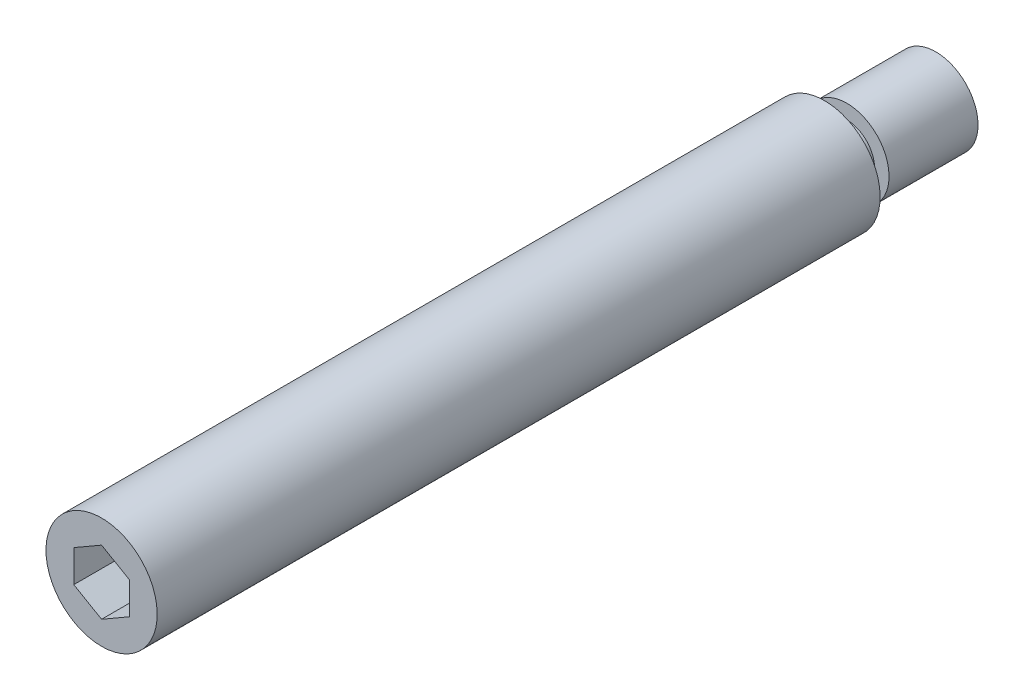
ISO-10303-21;
HEADER;
FILE_DESCRIPTION(('STEP AP214'),'2;1');
FILE_NAME('part.step','',(''),(''),'','','');
FILE_SCHEMA(('AUTOMOTIVE_DESIGN { 1 0 10303 214 1 1 1 1 }'));
ENDSEC;
DATA;
#1=APPLICATION_CONTEXT('core data for automotive mechanical design processes');
#2=APPLICATION_PROTOCOL_DEFINITION('international standard','automotive_design',2000,#1);
#3=PRODUCT_CONTEXT('',#1,'mechanical');
#4=PRODUCT('Part','Part','',(#3));
#5=PRODUCT_RELATED_PRODUCT_CATEGORY('part','',(#4));
#6=PRODUCT_DEFINITION_FORMATION('','',#4);
#7=PRODUCT_DEFINITION_CONTEXT('part definition',#1,'design');
#8=PRODUCT_DEFINITION('design','',#6,#7);
#9=PRODUCT_DEFINITION_SHAPE('','',#8);
#10=(LENGTH_UNIT() NAMED_UNIT(*) SI_UNIT(.MILLI.,.METRE.));
#11=(NAMED_UNIT(*) PLANE_ANGLE_UNIT() SI_UNIT($,.RADIAN.));
#12=(NAMED_UNIT(*) SI_UNIT($,.STERADIAN.) SOLID_ANGLE_UNIT());
#13=UNCERTAINTY_MEASURE_WITH_UNIT(LENGTH_MEASURE(1.E-05),#10,'distance_accuracy_value','');
#14=(GEOMETRIC_REPRESENTATION_CONTEXT(3) GLOBAL_UNCERTAINTY_ASSIGNED_CONTEXT((#13)) GLOBAL_UNIT_ASSIGNED_CONTEXT((#10,
#11,#12)) REPRESENTATION_CONTEXT('',''));
#15=CARTESIAN_POINT('',(0.,0.,0.));
#16=DIRECTION('',(0.,0.,1.));
#17=DIRECTION('',(1.,0.,0.));
#18=AXIS2_PLACEMENT_3D('',#15,#16,#17);
#19=CARTESIAN_POINT('',(0.,5.,10.));
#20=DIRECTION('',(0.,0.,-1.));
#21=DIRECTION('',(0.,1.,0.));
#22=AXIS2_PLACEMENT_3D('',#19,#20,#21);
#23=PLANE('',#22);
#24=CARTESIAN_POINT('',(0.,0.,10.));
#25=DIRECTION('',(0.,0.,1.));
#26=DIRECTION('',(0.,-1.,0.));
#27=AXIS2_PLACEMENT_3D('',#24,#25,#26);
#28=CIRCLE('',#27,2.5);
#29=CARTESIAN_POINT('',(0.,-2.5,10.));
#30=VERTEX_POINT('',#29);
#31=EDGE_CURVE('E115',#30,#30,#28,.T.);
#32=ORIENTED_EDGE('',*,*,#31,.T.);
#33=EDGE_LOOP('',(#32));
#34=FACE_BOUND('',#33,.T.);
#35=CARTESIAN_POINT('',(0.,0.,10.));
#36=DIRECTION('',(0.,0.,1.));
#37=DIRECTION('',(0.,-1.,0.));
#38=AXIS2_PLACEMENT_3D('',#35,#36,#37);
#39=CIRCLE('',#38,5.);
#40=CARTESIAN_POINT('',(0.,-5.,10.));
#41=VERTEX_POINT('',#40);
#42=EDGE_CURVE('E9',#41,#41,#39,.T.);
#43=ORIENTED_EDGE('',*,*,#42,.F.);
#44=EDGE_LOOP('',(#43));
#45=FACE_BOUND('',#44,.T.);
#46=ADVANCED_FACE('F14',(#34,#45),#23,.T.);
#47=CARTESIAN_POINT('',(0.,0.,20.));
#48=DIRECTION('',(0.,0.,1.));
#49=DIRECTION('',(0.,-1.,0.));
#50=AXIS2_PLACEMENT_3D('',#47,#48,#49);
#51=CYLINDRICAL_SURFACE('',#50,5.);
#52=CARTESIAN_POINT('',(0.,0.,75.));
#53=DIRECTION('',(0.,0.,1.));
#54=DIRECTION('',(0.,-1.,0.));
#55=AXIS2_PLACEMENT_3D('',#52,#53,#54);
#56=CIRCLE('',#55,5.);
#57=CARTESIAN_POINT('',(0.,-5.,75.));
#58=VERTEX_POINT('',#57);
#59=EDGE_CURVE('E21',#58,#58,#56,.T.);
#60=ORIENTED_EDGE('',*,*,#59,.F.);
#61=EDGE_LOOP('',(#60));
#62=FACE_BOUND('',#61,.T.);
#63=ORIENTED_EDGE('',*,*,#42,.T.);
#64=EDGE_LOOP('',(#63));
#65=FACE_BOUND('',#64,.T.);
#66=ADVANCED_FACE('F136',(#62,#65),#51,.T.);
#67=CARTESIAN_POINT('',(0.,5.,75.));
#68=DIRECTION('',(0.,0.,-1.));
#69=DIRECTION('',(0.,1.,0.));
#70=AXIS2_PLACEMENT_3D('',#67,#68,#69);
#71=PLANE('',#70);
#72=DIRECTION('',(-0.866025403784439,-0.5,0.));
#73=VECTOR('',#72,1.);
#74=CARTESIAN_POINT('',(0.,2.88675134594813,75.));
#75=LINE('',#74,#73);
#76=CARTESIAN_POINT('',(0.,2.88675134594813,75.));
#77=VERTEX_POINT('',#76);
#78=CARTESIAN_POINT('',(-2.5,1.44337567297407,75.));
#79=VERTEX_POINT('',#78);
#80=EDGE_CURVE('E102',#77,#79,#75,.T.);
#81=ORIENTED_EDGE('',*,*,#80,.F.);
#82=DIRECTION('',(-0.866025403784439,0.5,0.));
#83=VECTOR('',#82,1.);
#84=CARTESIAN_POINT('',(2.5,1.44337567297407,75.));
#85=LINE('',#84,#83);
#86=CARTESIAN_POINT('',(2.5,1.44337567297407,75.));
#87=VERTEX_POINT('',#86);
#88=EDGE_CURVE('E28',#87,#77,#85,.T.);
#89=ORIENTED_EDGE('',*,*,#88,.F.);
#90=DIRECTION('',(0.,1.,0.));
#91=VECTOR('',#90,1.);
#92=CARTESIAN_POINT('',(2.5,-1.44337567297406,75.));
#93=LINE('',#92,#91);
#94=CARTESIAN_POINT('',(2.5,-1.44337567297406,75.));
#95=VERTEX_POINT('',#94);
#96=EDGE_CURVE('E111',#95,#87,#93,.T.);
#97=ORIENTED_EDGE('',*,*,#96,.F.);
#98=DIRECTION('',(0.866025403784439,0.5,0.));
#99=VECTOR('',#98,1.);
#100=CARTESIAN_POINT('',(0.,-2.88675134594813,75.));
#101=LINE('',#100,#99);
#102=CARTESIAN_POINT('',(0.,-2.88675134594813,75.));
#103=VERTEX_POINT('',#102);
#104=EDGE_CURVE('E109',#103,#95,#101,.T.);
#105=ORIENTED_EDGE('',*,*,#104,.F.);
#106=DIRECTION('',(0.866025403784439,-0.5,0.));
#107=VECTOR('',#106,1.);
#108=CARTESIAN_POINT('',(-2.5,-1.44337567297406,75.));
#109=LINE('',#108,#107);
#110=CARTESIAN_POINT('',(-2.5,-1.44337567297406,75.));
#111=VERTEX_POINT('',#110);
#112=EDGE_CURVE('E76',#111,#103,#109,.T.);
#113=ORIENTED_EDGE('',*,*,#112,.F.);
#114=DIRECTION('',(0.,-1.,0.));
#115=VECTOR('',#114,1.);
#116=CARTESIAN_POINT('',(-2.5,1.44337567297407,75.));
#117=LINE('',#116,#115);
#118=EDGE_CURVE('E105',#79,#111,#117,.T.);
#119=ORIENTED_EDGE('',*,*,#118,.F.);
#120=EDGE_LOOP('',(#81,#89,#97,#105,#113,#119));
#121=FACE_BOUND('',#120,.T.);
#122=ORIENTED_EDGE('',*,*,#59,.T.);
#123=EDGE_LOOP('',(#122));
#124=FACE_BOUND('',#123,.T.);
#125=ADVANCED_FACE('F134',(#121,#124),#71,.F.);
#126=CARTESIAN_POINT('',(0.,3.8,0.));
#127=DIRECTION('',(0.,0.,-1.));
#128=DIRECTION('',(0.,1.,0.));
#129=AXIS2_PLACEMENT_3D('',#126,#127,#128);
#130=PLANE('',#129);
#131=CARTESIAN_POINT('',(0.,0.,0.));
#132=DIRECTION('',(0.,0.,1.));
#133=DIRECTION('',(0.,-1.,0.));
#134=AXIS2_PLACEMENT_3D('',#131,#132,#133);
#135=CIRCLE('',#134,3.8);
#136=CARTESIAN_POINT('',(0.,-3.8,0.));
#137=VERTEX_POINT('',#136);
#138=EDGE_CURVE('E129',#137,#137,#135,.T.);
#139=ORIENTED_EDGE('',*,*,#138,.F.);
#140=EDGE_LOOP('',(#139));
#141=FACE_BOUND('',#140,.T.);
#142=ADVANCED_FACE('F167',(#141),#130,.T.);
#143=CARTESIAN_POINT('',(0.,0.,20.));
#144=DIRECTION('',(0.,0.,1.));
#145=DIRECTION('',(0.,-1.,0.));
#146=AXIS2_PLACEMENT_3D('',#143,#144,#145);
#147=CYLINDRICAL_SURFACE('',#146,3.8);
#148=ORIENTED_EDGE('',*,*,#138,.T.);
#149=EDGE_LOOP('',(#148));
#150=FACE_BOUND('',#149,.T.);
#151=CARTESIAN_POINT('',(0.,0.,8.));
#152=DIRECTION('',(0.,0.,1.));
#153=DIRECTION('',(0.,-1.,0.));
#154=AXIS2_PLACEMENT_3D('',#151,#152,#153);
#155=CIRCLE('',#154,3.8);
#156=CARTESIAN_POINT('',(0.,-3.8,8.));
#157=VERTEX_POINT('',#156);
#158=EDGE_CURVE('E126',#157,#157,#155,.T.);
#159=ORIENTED_EDGE('',*,*,#158,.F.);
#160=EDGE_LOOP('',(#159));
#161=FACE_BOUND('',#160,.T.);
#162=ADVANCED_FACE('F160',(#150,#161),#147,.T.);
#163=CARTESIAN_POINT('',(0.,2.5,8.));
#164=DIRECTION('',(0.,0.,1.));
#165=DIRECTION('',(0.,-1.,0.));
#166=AXIS2_PLACEMENT_3D('',#163,#164,#165);
#167=PLANE('',#166);
#168=ORIENTED_EDGE('',*,*,#158,.T.);
#169=EDGE_LOOP('',(#168));
#170=FACE_BOUND('',#169,.T.);
#171=CARTESIAN_POINT('',(0.,0.,8.));
#172=DIRECTION('',(0.,0.,1.));
#173=DIRECTION('',(0.,-1.,0.));
#174=AXIS2_PLACEMENT_3D('',#171,#172,#173);
#175=CIRCLE('',#174,2.5);
#176=CARTESIAN_POINT('',(0.,-2.5,8.));
#177=VERTEX_POINT('',#176);
#178=EDGE_CURVE('E123',#177,#177,#175,.T.);
#179=ORIENTED_EDGE('',*,*,#178,.F.);
#180=EDGE_LOOP('',(#179));
#181=FACE_BOUND('',#180,.T.);
#182=ADVANCED_FACE('F151',(#170,#181),#167,.T.);
#183=CARTESIAN_POINT('',(0.,0.,20.));
#184=DIRECTION('',(0.,0.,1.));
#185=DIRECTION('',(0.,-1.,0.));
#186=AXIS2_PLACEMENT_3D('',#183,#184,#185);
#187=CYLINDRICAL_SURFACE('',#186,2.5);
#188=ORIENTED_EDGE('',*,*,#178,.T.);
#189=EDGE_LOOP('',(#188));
#190=FACE_BOUND('',#189,.T.);
#191=ORIENTED_EDGE('',*,*,#31,.F.);
#192=EDGE_LOOP('',(#191));
#193=FACE_BOUND('',#192,.T.);
#194=ADVANCED_FACE('F148',(#190,#193),#187,.T.);
#195=CARTESIAN_POINT('',(2.5,1.44337567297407,69.));
#196=DIRECTION('',(0.5,0.866025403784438,0.));
#197=DIRECTION('',(-0.866025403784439,0.5,0.));
#198=AXIS2_PLACEMENT_3D('',#195,#196,#197);
#199=PLANE('',#198);
#200=ORIENTED_EDGE('',*,*,#88,.T.);
#201=DIRECTION('',(0.,0.,1.));
#202=VECTOR('',#201,1.);
#203=CARTESIAN_POINT('',(0.,2.88675134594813,69.));
#204=LINE('',#203,#202);
#205=CARTESIAN_POINT('',(0.,2.88675134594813,69.));
#206=VERTEX_POINT('',#205);
#207=EDGE_CURVE('E58',#206,#77,#204,.T.);
#208=ORIENTED_EDGE('',*,*,#207,.F.);
#209=DIRECTION('',(-0.866025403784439,0.5,0.));
#210=VECTOR('',#209,1.);
#211=CARTESIAN_POINT('',(2.5,1.44337567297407,69.));
#212=LINE('',#211,#210);
#213=CARTESIAN_POINT('',(2.5,1.44337567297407,69.));
#214=VERTEX_POINT('',#213);
#215=EDGE_CURVE('E113',#214,#206,#212,.T.);
#216=ORIENTED_EDGE('',*,*,#215,.F.);
#217=DIRECTION('',(0.,0.,1.));
#218=VECTOR('',#217,1.);
#219=CARTESIAN_POINT('',(2.5,1.44337567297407,69.));
#220=LINE('',#219,#218);
#221=EDGE_CURVE('E36',#214,#87,#220,.T.);
#222=ORIENTED_EDGE('',*,*,#221,.T.);
#223=EDGE_LOOP('',(#200,#208,#216,#222));
#224=FACE_BOUND('',#223,.T.);
#225=ADVANCED_FACE('F150',(#224),#199,.F.);
#226=CARTESIAN_POINT('',(2.5,-1.44337567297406,69.));
#227=DIRECTION('',(1.,0.,0.));
#228=DIRECTION('',(0.,0.,-1.));
#229=AXIS2_PLACEMENT_3D('',#226,#227,#228);
#230=PLANE('',#229);
#231=ORIENTED_EDGE('',*,*,#96,.T.);
#232=ORIENTED_EDGE('',*,*,#221,.F.);
#233=DIRECTION('',(0.,1.,0.));
#234=VECTOR('',#233,1.);
#235=CARTESIAN_POINT('',(2.5,-1.44337567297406,69.));
#236=LINE('',#235,#234);
#237=CARTESIAN_POINT('',(2.5,-1.44337567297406,69.));
#238=VERTEX_POINT('',#237);
#239=EDGE_CURVE('E88',#238,#214,#236,.T.);
#240=ORIENTED_EDGE('',*,*,#239,.F.);
#241=DIRECTION('',(0.,0.,1.));
#242=VECTOR('',#241,1.);
#243=CARTESIAN_POINT('',(2.5,-1.44337567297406,69.));
#244=LINE('',#243,#242);
#245=EDGE_CURVE('E80',#238,#95,#244,.T.);
#246=ORIENTED_EDGE('',*,*,#245,.T.);
#247=EDGE_LOOP('',(#231,#232,#240,#246));
#248=FACE_BOUND('',#247,.T.);
#249=ADVANCED_FACE('F158',(#248),#230,.F.);
#250=CARTESIAN_POINT('',(0.,-2.88675134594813,69.));
#251=DIRECTION('',(0.5,-0.866025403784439,0.));
#252=DIRECTION('',(0.866025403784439,0.5,0.));
#253=AXIS2_PLACEMENT_3D('',#250,#251,#252);
#254=PLANE('',#253);
#255=ORIENTED_EDGE('',*,*,#104,.T.);
#256=ORIENTED_EDGE('',*,*,#245,.F.);
#257=DIRECTION('',(0.866025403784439,0.5,0.));
#258=VECTOR('',#257,1.);
#259=CARTESIAN_POINT('',(0.,-2.88675134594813,69.));
#260=LINE('',#259,#258);
#261=CARTESIAN_POINT('',(0.,-2.88675134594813,69.));
#262=VERTEX_POINT('',#261);
#263=EDGE_CURVE('E84',#262,#238,#260,.T.);
#264=ORIENTED_EDGE('',*,*,#263,.F.);
#265=DIRECTION('',(0.,0.,1.));
#266=VECTOR('',#265,1.);
#267=CARTESIAN_POINT('',(0.,-2.88675134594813,69.));
#268=LINE('',#267,#266);
#269=EDGE_CURVE('E69',#262,#103,#268,.T.);
#270=ORIENTED_EDGE('',*,*,#269,.T.);
#271=EDGE_LOOP('',(#255,#256,#264,#270));
#272=FACE_BOUND('',#271,.T.);
#273=ADVANCED_FACE('F85',(#272),#254,.F.);
#274=CARTESIAN_POINT('',(-2.5,-1.44337567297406,69.));
#275=DIRECTION('',(-0.5,-0.866025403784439,0.));
#276=DIRECTION('',(0.866025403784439,-0.5,0.));
#277=AXIS2_PLACEMENT_3D('',#274,#275,#276);
#278=PLANE('',#277);
#279=ORIENTED_EDGE('',*,*,#112,.T.);
#280=ORIENTED_EDGE('',*,*,#269,.F.);
#281=DIRECTION('',(0.866025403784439,-0.5,0.));
#282=VECTOR('',#281,1.);
#283=CARTESIAN_POINT('',(-2.5,-1.44337567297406,69.));
#284=LINE('',#283,#282);
#285=CARTESIAN_POINT('',(-2.5,-1.44337567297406,69.));
#286=VERTEX_POINT('',#285);
#287=EDGE_CURVE('E73',#286,#262,#284,.T.);
#288=ORIENTED_EDGE('',*,*,#287,.F.);
#289=DIRECTION('',(0.,0.,1.));
#290=VECTOR('',#289,1.);
#291=CARTESIAN_POINT('',(-2.5,-1.44337567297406,69.));
#292=LINE('',#291,#290);
#293=EDGE_CURVE('E81',#286,#111,#292,.T.);
#294=ORIENTED_EDGE('',*,*,#293,.T.);
#295=EDGE_LOOP('',(#279,#280,#288,#294));
#296=FACE_BOUND('',#295,.T.);
#297=ADVANCED_FACE('F71',(#296),#278,.F.);
#298=CARTESIAN_POINT('',(-2.5,1.44337567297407,69.));
#299=DIRECTION('',(-1.,0.,0.));
#300=DIRECTION('',(0.,-1.,0.));
#301=AXIS2_PLACEMENT_3D('',#298,#299,#300);
#302=PLANE('',#301);
#303=ORIENTED_EDGE('',*,*,#118,.T.);
#304=ORIENTED_EDGE('',*,*,#293,.F.);
#305=DIRECTION('',(0.,-1.,0.));
#306=VECTOR('',#305,1.);
#307=CARTESIAN_POINT('',(-2.5,1.44337567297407,69.));
#308=LINE('',#307,#306);
#309=CARTESIAN_POINT('',(-2.5,1.44337567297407,69.));
#310=VERTEX_POINT('',#309);
#311=EDGE_CURVE('E94',#310,#286,#308,.T.);
#312=ORIENTED_EDGE('',*,*,#311,.F.);
#313=DIRECTION('',(0.,0.,1.));
#314=VECTOR('',#313,1.);
#315=CARTESIAN_POINT('',(-2.5,1.44337567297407,69.));
#316=LINE('',#315,#314);
#317=EDGE_CURVE('E118',#310,#79,#316,.T.);
#318=ORIENTED_EDGE('',*,*,#317,.T.);
#319=EDGE_LOOP('',(#303,#304,#312,#318));
#320=FACE_BOUND('',#319,.T.);
#321=ADVANCED_FACE('F192',(#320),#302,.F.);
#322=CARTESIAN_POINT('',(0.,2.88675134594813,69.));
#323=DIRECTION('',(-0.5,0.866025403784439,0.));
#324=DIRECTION('',(-0.866025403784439,-0.5,0.));
#325=AXIS2_PLACEMENT_3D('',#322,#323,#324);
#326=PLANE('',#325);
#327=ORIENTED_EDGE('',*,*,#80,.T.);
#328=ORIENTED_EDGE('',*,*,#317,.F.);
#329=DIRECTION('',(-0.866025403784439,-0.5,0.));
#330=VECTOR('',#329,1.);
#331=CARTESIAN_POINT('',(0.,2.88675134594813,69.));
#332=LINE('',#331,#330);
#333=EDGE_CURVE('E96',#206,#310,#332,.T.);
#334=ORIENTED_EDGE('',*,*,#333,.F.);
#335=ORIENTED_EDGE('',*,*,#207,.T.);
#336=EDGE_LOOP('',(#327,#328,#334,#335));
#337=FACE_BOUND('',#336,.T.);
#338=ADVANCED_FACE('F180',(#337),#326,.F.);
#339=CARTESIAN_POINT('',(0.,2.88675134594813,69.));
#340=DIRECTION('',(0.,0.,1.));
#341=DIRECTION('',(1.,0.,0.));
#342=AXIS2_PLACEMENT_3D('',#339,#340,#341);
#343=PLANE('',#342);
#344=ORIENTED_EDGE('',*,*,#215,.T.);
#345=ORIENTED_EDGE('',*,*,#333,.T.);
#346=ORIENTED_EDGE('',*,*,#311,.T.);
#347=ORIENTED_EDGE('',*,*,#287,.T.);
#348=ORIENTED_EDGE('',*,*,#263,.T.);
#349=ORIENTED_EDGE('',*,*,#239,.T.);
#350=EDGE_LOOP('',(#344,#345,#346,#347,#348,#349));
#351=FACE_BOUND('',#350,.T.);
#352=ADVANCED_FACE('F91',(#351),#343,.T.);
#353=CLOSED_SHELL('',(#46,#66,#125,#142,#162,#182,#194,#225,#249,#273,#297,#321,#338,#352));
#354=MANIFOLD_SOLID_BREP('B1',#353);
#355=ADVANCED_BREP_SHAPE_REPRESENTATION('',(#18,#354),#14);
#356=SHAPE_DEFINITION_REPRESENTATION(#9,#355);
ENDSEC;
END-ISO-10303-21;
